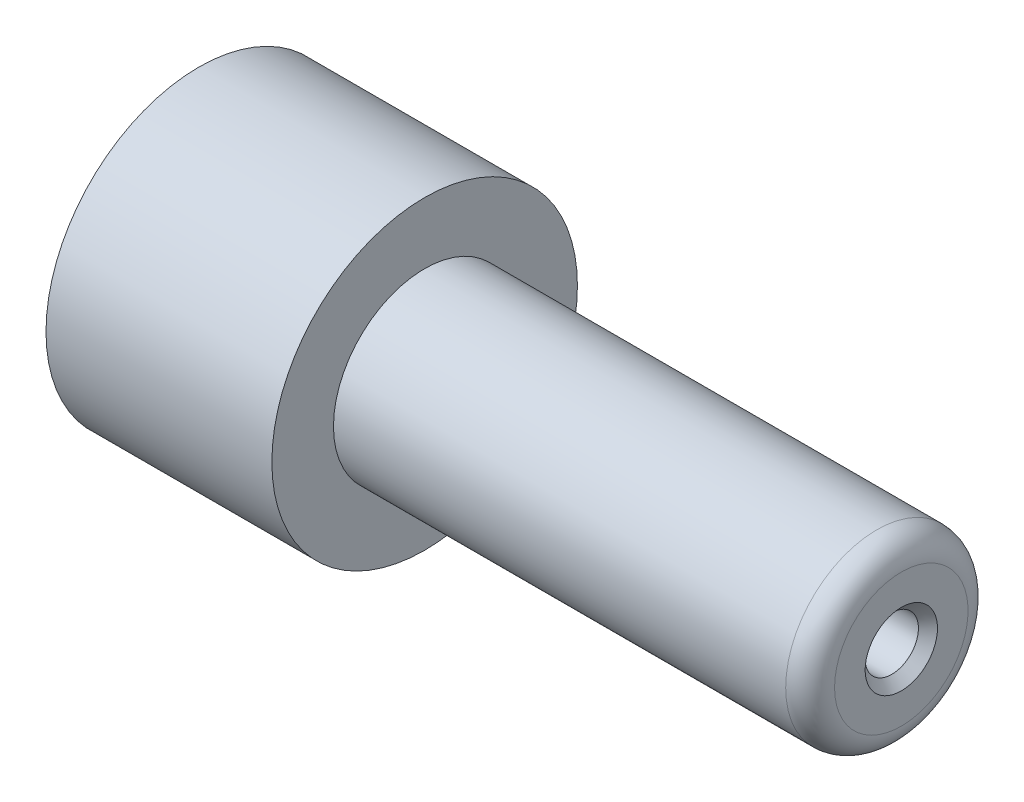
from build123d import *

# Parameters (mm, degrees)
SKETCH2_R          = 1.1811
CUT_EXTRUDE1_DEPTH = 2.3876
SKETCH3_R          = 1.3843
CUT_EXTRUDE2_DEPTH = 9.525
CHAMFER1_SIZE      = 0.4953


with BuildPart() as part:
    # Sketch1 → Revolve1 (revolve)
    with BuildSketch(Plane.XY, mode=Mode.PRIVATE) as revolve1_sk:
        with BuildLine():
            Line((0, 3.5687), (0, 7.9375))
            Line((0, 7.9375), (11.7348, 7.9375))
            Line((11.7348, 7.9375), (11.7348, 4.7371))
            Line((11.7348, 4.7371), (35.2298, 4.7371))
            ThreePointArc((35.2298, 4.7371), (36.127825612, 4.365125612), (36.4998, 3.4671))
            Line((36.4998, 3.4671), (36.4998, 0))
            Line((36.4998, 0), (24.4856, 0))
            Line((24.4856, 0), (24.4856, 3.5687))
            Line((24.4856, 3.5687), (0, 3.5687))
        make_face()
    revolve(revolve1_sk.sketch.rotate(Axis((0, 0, 0), (1, 0, 0)), 90), axis=Axis((0, 0, 0), (1, 0, 0)))

    # Sketch2 → Cut-Extrude1 (cut)
    with BuildSketch(Plane.ZY):
        with Locations((0, 5.5499)):
            Circle(SKETCH2_R)
        with Locations(Location((0, -5.5499, 0), (0, 0, 180))):
            Circle(SKETCH2_R)
    extrude(amount=-CUT_EXTRUDE1_DEPTH, mode=Mode.SUBTRACT)

    # Sketch3 → Cut-Extrude2 (cut)
    with BuildSketch(Plane(origin=(36.4998, 0, 0), x_dir=(0, 0, -1), z_dir=(1, 0, 0))):
        Circle(SKETCH3_R)
    extrude(amount=-CUT_EXTRUDE2_DEPTH, mode=Mode.SUBTRACT)

    # Chamfer1
    chamfer1_edges = [part.edges().sort_by_distance(p)[0] for p in [
        (36.4998, 0, 1.3843),
    ]]
    chamfer(chamfer1_edges, length=CHAMFER1_SIZE)


solid = part.part
